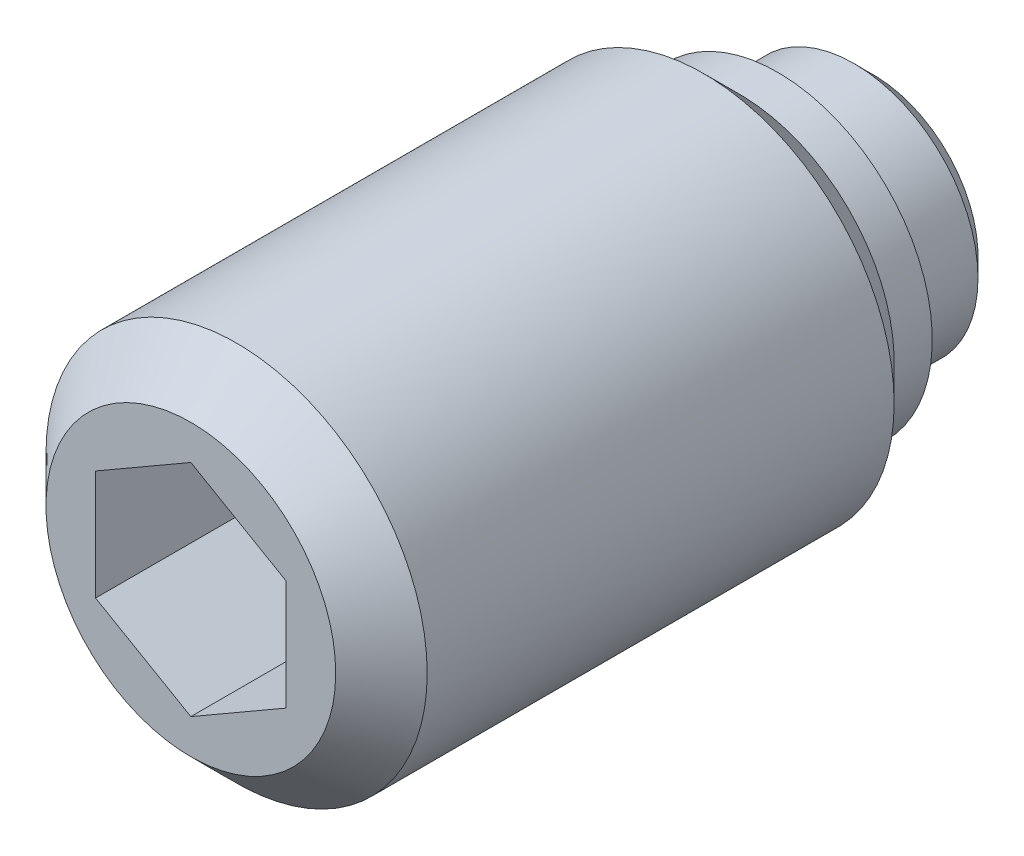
ISO-10303-21;
HEADER;
FILE_DESCRIPTION(('STEP AP214'),'2;1');
FILE_NAME('part.step','',(''),(''),'','','');
FILE_SCHEMA(('AUTOMOTIVE_DESIGN { 1 0 10303 214 1 1 1 1 }'));
ENDSEC;
DATA;
#1=APPLICATION_CONTEXT('core data for automotive mechanical design processes');
#2=APPLICATION_PROTOCOL_DEFINITION('international standard','automotive_design',2000,#1);
#3=PRODUCT_CONTEXT('',#1,'mechanical');
#4=PRODUCT('Part','Part','',(#3));
#5=PRODUCT_RELATED_PRODUCT_CATEGORY('part','',(#4));
#6=PRODUCT_DEFINITION_FORMATION('','',#4);
#7=PRODUCT_DEFINITION_CONTEXT('part definition',#1,'design');
#8=PRODUCT_DEFINITION('design','',#6,#7);
#9=PRODUCT_DEFINITION_SHAPE('','',#8);
#10=(LENGTH_UNIT() NAMED_UNIT(*) SI_UNIT(.MILLI.,.METRE.));
#11=(NAMED_UNIT(*) PLANE_ANGLE_UNIT() SI_UNIT($,.RADIAN.));
#12=(NAMED_UNIT(*) SI_UNIT($,.STERADIAN.) SOLID_ANGLE_UNIT());
#13=UNCERTAINTY_MEASURE_WITH_UNIT(LENGTH_MEASURE(1.E-05),#10,'distance_accuracy_value','');
#14=(GEOMETRIC_REPRESENTATION_CONTEXT(3) GLOBAL_UNCERTAINTY_ASSIGNED_CONTEXT((#13)) GLOBAL_UNIT_ASSIGNED_CONTEXT((#10,
#11,#12)) REPRESENTATION_CONTEXT('',''));
#15=CARTESIAN_POINT('',(0.,0.,0.));
#16=DIRECTION('',(0.,0.,1.));
#17=DIRECTION('',(1.,0.,0.));
#18=AXIS2_PLACEMENT_3D('',#15,#16,#17);
#19=CARTESIAN_POINT('',(0.,0.,0.));
#20=DIRECTION('',(0.,0.,-1.));
#21=DIRECTION('',(-1.,0.,0.));
#22=AXIS2_PLACEMENT_3D('',#19,#20,#21);
#23=CYLINDRICAL_SURFACE('',#22,3.25);
#24=CARTESIAN_POINT('',(0.,0.,0.5));
#25=DIRECTION('',(0.,0.,-1.));
#26=DIRECTION('',(-1.,0.,0.));
#27=AXIS2_PLACEMENT_3D('',#24,#25,#26);
#28=CIRCLE('',#27,3.25);
#29=CARTESIAN_POINT('',(-3.25,0.,0.5));
#30=VERTEX_POINT('',#29);
#31=EDGE_CURVE('E133',#30,#30,#28,.T.);
#32=ORIENTED_EDGE('',*,*,#31,.F.);
#33=EDGE_LOOP('',(#32));
#34=FACE_BOUND('',#33,.T.);
#35=CARTESIAN_POINT('',(0.,0.,2.5));
#36=DIRECTION('',(0.,0.,-1.));
#37=DIRECTION('',(-1.,0.,0.));
#38=AXIS2_PLACEMENT_3D('',#35,#36,#37);
#39=CIRCLE('',#38,3.25);
#40=CARTESIAN_POINT('',(-3.25,0.,2.5));
#41=VERTEX_POINT('',#40);
#42=EDGE_CURVE('E127',#41,#41,#39,.T.);
#43=ORIENTED_EDGE('',*,*,#42,.T.);
#44=EDGE_LOOP('',(#43));
#45=FACE_BOUND('',#44,.T.);
#46=ADVANCED_FACE('F14',(#34,#45),#23,.T.);
#47=CARTESIAN_POINT('',(0.,0.,0.5));
#48=DIRECTION('',(0.,0.,1.));
#49=DIRECTION('',(1.,0.,0.));
#50=AXIS2_PLACEMENT_3D('',#47,#48,#49);
#51=CONICAL_SURFACE('',#50,3.25,0.785398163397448);
#52=CARTESIAN_POINT('',(0.,0.,0.));
#53=DIRECTION('',(0.,0.,-1.));
#54=DIRECTION('',(-1.,0.,0.));
#55=AXIS2_PLACEMENT_3D('',#52,#53,#54);
#56=CIRCLE('',#55,2.75);
#57=CARTESIAN_POINT('',(-2.75,0.,0.));
#58=VERTEX_POINT('',#57);
#59=EDGE_CURVE('E130',#58,#58,#56,.T.);
#60=ORIENTED_EDGE('',*,*,#59,.F.);
#61=EDGE_LOOP('',(#60));
#62=FACE_BOUND('',#61,.T.);
#63=ORIENTED_EDGE('',*,*,#31,.T.);
#64=EDGE_LOOP('',(#63));
#65=FACE_BOUND('',#64,.T.);
#66=ADVANCED_FACE('F159',(#62,#65),#51,.T.);
#67=CARTESIAN_POINT('',(0.,2.75,0.));
#68=DIRECTION('',(0.,0.,1.));
#69=DIRECTION('',(1.,0.,0.));
#70=AXIS2_PLACEMENT_3D('',#67,#68,#69);
#71=PLANE('',#70);
#72=ORIENTED_EDGE('',*,*,#59,.T.);
#73=EDGE_LOOP('',(#72));
#74=FACE_BOUND('',#73,.T.);
#75=ADVANCED_FACE('F165',(#74),#71,.F.);
#76=CARTESIAN_POINT('',(0.,0.,2.5));
#77=DIRECTION('',(0.,0.,-1.));
#78=DIRECTION('',(-1.,0.,0.));
#79=AXIS2_PLACEMENT_3D('',#76,#77,#78);
#80=CYLINDRICAL_SURFACE('',#79,5.);
#81=CARTESIAN_POINT('',(0.,0.,4.45));
#82=DIRECTION('',(0.,0.,-1.));
#83=DIRECTION('',(-1.,0.,0.));
#84=AXIS2_PLACEMENT_3D('',#81,#82,#83);
#85=CIRCLE('',#84,5.);
#86=CARTESIAN_POINT('',(-5.,0.,4.45));
#87=VERTEX_POINT('',#86);
#88=EDGE_CURVE('E9',#87,#87,#85,.T.);
#89=ORIENTED_EDGE('',*,*,#88,.F.);
#90=EDGE_LOOP('',(#89));
#91=FACE_BOUND('',#90,.T.);
#92=CARTESIAN_POINT('',(0.,0.,16.7));
#93=DIRECTION('',(0.,0.,1.));
#94=DIRECTION('',(1.,0.,0.));
#95=AXIS2_PLACEMENT_3D('',#92,#93,#94);
#96=CIRCLE('',#95,5.);
#97=CARTESIAN_POINT('',(5.,0.,16.7));
#98=VERTEX_POINT('',#97);
#99=EDGE_CURVE('E124',#98,#98,#96,.T.);
#100=ORIENTED_EDGE('',*,*,#99,.F.);
#101=EDGE_LOOP('',(#100));
#102=FACE_BOUND('',#101,.T.);
#103=ADVANCED_FACE('F16',(#91,#102),#80,.T.);
#104=CARTESIAN_POINT('',(0.,4.05,2.5));
#105=DIRECTION('',(0.,0.,1.));
#106=DIRECTION('',(1.,0.,0.));
#107=AXIS2_PLACEMENT_3D('',#104,#105,#106);
#108=PLANE('',#107);
#109=CARTESIAN_POINT('',(0.,0.,2.5));
#110=DIRECTION('',(0.,0.,-1.));
#111=DIRECTION('',(-1.,0.,0.));
#112=AXIS2_PLACEMENT_3D('',#109,#110,#111);
#113=CIRCLE('',#112,4.05);
#114=CARTESIAN_POINT('',(-4.05,0.,2.5));
#115=VERTEX_POINT('',#114);
#116=EDGE_CURVE('E136',#115,#115,#113,.T.);
#117=ORIENTED_EDGE('',*,*,#116,.T.);
#118=EDGE_LOOP('',(#117));
#119=FACE_BOUND('',#118,.T.);
#120=ORIENTED_EDGE('',*,*,#42,.F.);
#121=EDGE_LOOP('',(#120));
#122=FACE_BOUND('',#121,.T.);
#123=ADVANCED_FACE('F156',(#119,#122),#108,.F.);
#124=CARTESIAN_POINT('',(0.,0.,2.5));
#125=DIRECTION('',(0.,0.,-1.));
#126=DIRECTION('',(-1.,0.,0.));
#127=AXIS2_PLACEMENT_3D('',#124,#125,#126);
#128=CYLINDRICAL_SURFACE('',#127,4.05);
#129=CARTESIAN_POINT('',(0.,0.,3.5));
#130=DIRECTION('',(0.,0.,-1.));
#131=DIRECTION('',(-1.,0.,0.));
#132=AXIS2_PLACEMENT_3D('',#129,#130,#131);
#133=CIRCLE('',#132,4.05);
#134=CARTESIAN_POINT('',(-4.05,0.,3.5));
#135=VERTEX_POINT('',#134);
#136=EDGE_CURVE('E22',#135,#135,#133,.T.);
#137=ORIENTED_EDGE('',*,*,#136,.T.);
#138=EDGE_LOOP('',(#137));
#139=FACE_BOUND('',#138,.T.);
#140=ORIENTED_EDGE('',*,*,#116,.F.);
#141=EDGE_LOOP('',(#140));
#142=FACE_BOUND('',#141,.T.);
#143=ADVANCED_FACE('F141',(#139,#142),#128,.T.);
#144=CARTESIAN_POINT('',(0.,0.,4.45));
#145=DIRECTION('',(0.,0.,1.));
#146=DIRECTION('',(1.,0.,0.));
#147=AXIS2_PLACEMENT_3D('',#144,#145,#146);
#148=CONICAL_SURFACE('',#147,5.,0.785398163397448);
#149=ORIENTED_EDGE('',*,*,#88,.T.);
#150=EDGE_LOOP('',(#149));
#151=FACE_BOUND('',#150,.T.);
#152=ORIENTED_EDGE('',*,*,#136,.F.);
#153=EDGE_LOOP('',(#152));
#154=FACE_BOUND('',#153,.T.);
#155=ADVANCED_FACE('F144',(#151,#154),#148,.T.);
#156=CARTESIAN_POINT('',(0.,-3.8,17.9));
#157=DIRECTION('',(0.,0.,1.));
#158=DIRECTION('',(1.,0.,0.));
#159=AXIS2_PLACEMENT_3D('',#156,#157,#158);
#160=PLANE('',#159);
#161=DIRECTION('',(0.866025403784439,-0.5,0.));
#162=VECTOR('',#161,1.);
#163=CARTESIAN_POINT('',(-2.5,-1.44337567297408,17.9));
#164=LINE('',#163,#162);
#165=CARTESIAN_POINT('',(-2.5,-1.44337567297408,17.9));
#166=VERTEX_POINT('',#165);
#167=CARTESIAN_POINT('',(0.,-2.88675134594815,17.9));
#168=VERTEX_POINT('',#167);
#169=EDGE_CURVE('E29',#166,#168,#164,.T.);
#170=ORIENTED_EDGE('',*,*,#169,.F.);
#171=DIRECTION('',(0.,-1.,0.));
#172=VECTOR('',#171,1.);
#173=CARTESIAN_POINT('',(-2.5,1.44337567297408,17.9));
#174=LINE('',#173,#172);
#175=CARTESIAN_POINT('',(-2.5,1.44337567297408,17.9));
#176=VERTEX_POINT('',#175);
#177=EDGE_CURVE('E112',#176,#166,#174,.T.);
#178=ORIENTED_EDGE('',*,*,#177,.F.);
#179=DIRECTION('',(-0.866025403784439,-0.5,0.));
#180=VECTOR('',#179,1.);
#181=CARTESIAN_POINT('',(0.,2.88675134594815,17.9));
#182=LINE('',#181,#180);
#183=CARTESIAN_POINT('',(0.,2.88675134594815,17.9));
#184=VERTEX_POINT('',#183);
#185=EDGE_CURVE('E110',#184,#176,#182,.T.);
#186=ORIENTED_EDGE('',*,*,#185,.F.);
#187=DIRECTION('',(-0.866025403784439,0.5,0.));
#188=VECTOR('',#187,1.);
#189=CARTESIAN_POINT('',(2.5,1.44337567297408,17.9));
#190=LINE('',#189,#188);
#191=CARTESIAN_POINT('',(2.5,1.44337567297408,17.9));
#192=VERTEX_POINT('',#191);
#193=EDGE_CURVE('E77',#192,#184,#190,.T.);
#194=ORIENTED_EDGE('',*,*,#193,.F.);
#195=DIRECTION('',(0.,1.,0.));
#196=VECTOR('',#195,1.);
#197=CARTESIAN_POINT('',(2.5,-1.44337567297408,17.9));
#198=LINE('',#197,#196);
#199=CARTESIAN_POINT('',(2.5,-1.44337567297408,17.9));
#200=VERTEX_POINT('',#199);
#201=EDGE_CURVE('E106',#200,#192,#198,.T.);
#202=ORIENTED_EDGE('',*,*,#201,.F.);
#203=DIRECTION('',(0.866025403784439,0.5,0.));
#204=VECTOR('',#203,1.);
#205=CARTESIAN_POINT('',(0.,-2.88675134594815,17.9));
#206=LINE('',#205,#204);
#207=EDGE_CURVE('E103',#168,#200,#206,.T.);
#208=ORIENTED_EDGE('',*,*,#207,.F.);
#209=EDGE_LOOP('',(#170,#178,#186,#194,#202,#208));
#210=FACE_BOUND('',#209,.T.);
#211=CARTESIAN_POINT('',(0.,0.,17.9));
#212=DIRECTION('',(0.,0.,1.));
#213=DIRECTION('',(1.,0.,0.));
#214=AXIS2_PLACEMENT_3D('',#211,#212,#213);
#215=CIRCLE('',#214,3.8);
#216=CARTESIAN_POINT('',(3.8,0.,17.9));
#217=VERTEX_POINT('',#216);
#218=EDGE_CURVE('E116',#217,#217,#215,.T.);
#219=ORIENTED_EDGE('',*,*,#218,.T.);
#220=EDGE_LOOP('',(#219));
#221=FACE_BOUND('',#220,.T.);
#222=ADVANCED_FACE('F146',(#210,#221),#160,.T.);
#223=CARTESIAN_POINT('',(0.,0.,17.9));
#224=DIRECTION('',(0.,0.,-1.));
#225=DIRECTION('',(-1.,0.,0.));
#226=AXIS2_PLACEMENT_3D('',#223,#224,#225);
#227=CONICAL_SURFACE('',#226,3.8,0.785398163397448);
#228=ORIENTED_EDGE('',*,*,#99,.T.);
#229=EDGE_LOOP('',(#228));
#230=FACE_BOUND('',#229,.T.);
#231=ORIENTED_EDGE('',*,*,#218,.F.);
#232=EDGE_LOOP('',(#231));
#233=FACE_BOUND('',#232,.T.);
#234=ADVANCED_FACE('F153',(#230,#233),#227,.T.);
#235=CARTESIAN_POINT('',(-2.5,-1.44337567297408,11.9));
#236=DIRECTION('',(-0.5,-0.866025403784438,0.));
#237=DIRECTION('',(0.866025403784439,-0.5,0.));
#238=AXIS2_PLACEMENT_3D('',#235,#236,#237);
#239=PLANE('',#238);
#240=ORIENTED_EDGE('',*,*,#169,.T.);
#241=DIRECTION('',(0.,0.,1.));
#242=VECTOR('',#241,1.);
#243=CARTESIAN_POINT('',(0.,-2.88675134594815,11.9));
#244=LINE('',#243,#242);
#245=CARTESIAN_POINT('',(0.,-2.88675134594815,11.9));
#246=VERTEX_POINT('',#245);
#247=EDGE_CURVE('E59',#246,#168,#244,.T.);
#248=ORIENTED_EDGE('',*,*,#247,.F.);
#249=DIRECTION('',(0.866025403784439,-0.5,0.));
#250=VECTOR('',#249,1.);
#251=CARTESIAN_POINT('',(-2.5,-1.44337567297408,11.9));
#252=LINE('',#251,#250);
#253=CARTESIAN_POINT('',(-2.5,-1.44337567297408,11.9));
#254=VERTEX_POINT('',#253);
#255=EDGE_CURVE('E114',#254,#246,#252,.T.);
#256=ORIENTED_EDGE('',*,*,#255,.F.);
#257=DIRECTION('',(0.,0.,1.));
#258=VECTOR('',#257,1.);
#259=CARTESIAN_POINT('',(-2.5,-1.44337567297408,11.9));
#260=LINE('',#259,#258);
#261=EDGE_CURVE('E37',#254,#166,#260,.T.);
#262=ORIENTED_EDGE('',*,*,#261,.T.);
#263=EDGE_LOOP('',(#240,#248,#256,#262));
#264=FACE_BOUND('',#263,.T.);
#265=ADVANCED_FACE('F191',(#264),#239,.F.);
#266=CARTESIAN_POINT('',(-2.5,1.44337567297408,11.9));
#267=DIRECTION('',(-1.,0.,0.));
#268=DIRECTION('',(0.,0.,1.));
#269=AXIS2_PLACEMENT_3D('',#266,#267,#268);
#270=PLANE('',#269);
#271=ORIENTED_EDGE('',*,*,#177,.T.);
#272=ORIENTED_EDGE('',*,*,#261,.F.);
#273=DIRECTION('',(0.,-1.,0.));
#274=VECTOR('',#273,1.);
#275=CARTESIAN_POINT('',(-2.5,1.44337567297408,11.9));
#276=LINE('',#275,#274);
#277=CARTESIAN_POINT('',(-2.5,1.44337567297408,11.9));
#278=VERTEX_POINT('',#277);
#279=EDGE_CURVE('E89',#278,#254,#276,.T.);
#280=ORIENTED_EDGE('',*,*,#279,.F.);
#281=DIRECTION('',(0.,0.,1.));
#282=VECTOR('',#281,1.);
#283=CARTESIAN_POINT('',(-2.5,1.44337567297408,11.9));
#284=LINE('',#283,#282);
#285=EDGE_CURVE('E81',#278,#176,#284,.T.);
#286=ORIENTED_EDGE('',*,*,#285,.T.);
#287=EDGE_LOOP('',(#271,#272,#280,#286));
#288=FACE_BOUND('',#287,.T.);
#289=ADVANCED_FACE('F198',(#288),#270,.F.);
#290=CARTESIAN_POINT('',(0.,2.88675134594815,11.9));
#291=DIRECTION('',(-0.5,0.866025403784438,0.));
#292=DIRECTION('',(-0.866025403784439,-0.5,0.));
#293=AXIS2_PLACEMENT_3D('',#290,#291,#292);
#294=PLANE('',#293);
#295=ORIENTED_EDGE('',*,*,#185,.T.);
#296=ORIENTED_EDGE('',*,*,#285,.F.);
#297=DIRECTION('',(-0.866025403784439,-0.5,0.));
#298=VECTOR('',#297,1.);
#299=CARTESIAN_POINT('',(0.,2.88675134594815,11.9));
#300=LINE('',#299,#298);
#301=CARTESIAN_POINT('',(0.,2.88675134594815,11.9));
#302=VERTEX_POINT('',#301);
#303=EDGE_CURVE('E85',#302,#278,#300,.T.);
#304=ORIENTED_EDGE('',*,*,#303,.F.);
#305=DIRECTION('',(0.,0.,1.));
#306=VECTOR('',#305,1.);
#307=CARTESIAN_POINT('',(0.,2.88675134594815,11.9));
#308=LINE('',#307,#306);
#309=EDGE_CURVE('E70',#302,#184,#308,.T.);
#310=ORIENTED_EDGE('',*,*,#309,.T.);
#311=EDGE_LOOP('',(#295,#296,#304,#310));
#312=FACE_BOUND('',#311,.T.);
#313=ADVANCED_FACE('F86',(#312),#294,.F.);
#314=CARTESIAN_POINT('',(2.5,1.44337567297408,11.9));
#315=DIRECTION('',(0.5,0.866025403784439,0.));
#316=DIRECTION('',(-0.866025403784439,0.5,0.));
#317=AXIS2_PLACEMENT_3D('',#314,#315,#316);
#318=PLANE('',#317);
#319=ORIENTED_EDGE('',*,*,#193,.T.);
#320=ORIENTED_EDGE('',*,*,#309,.F.);
#321=DIRECTION('',(-0.866025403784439,0.5,0.));
#322=VECTOR('',#321,1.);
#323=CARTESIAN_POINT('',(2.5,1.44337567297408,11.9));
#324=LINE('',#323,#322);
#325=CARTESIAN_POINT('',(2.5,1.44337567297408,11.9));
#326=VERTEX_POINT('',#325);
#327=EDGE_CURVE('E74',#326,#302,#324,.T.);
#328=ORIENTED_EDGE('',*,*,#327,.F.);
#329=DIRECTION('',(0.,0.,1.));
#330=VECTOR('',#329,1.);
#331=CARTESIAN_POINT('',(2.5,1.44337567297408,11.9));
#332=LINE('',#331,#330);
#333=EDGE_CURVE('E82',#326,#192,#332,.T.);
#334=ORIENTED_EDGE('',*,*,#333,.T.);
#335=EDGE_LOOP('',(#319,#320,#328,#334));
#336=FACE_BOUND('',#335,.T.);
#337=ADVANCED_FACE('F72',(#336),#318,.F.);
#338=CARTESIAN_POINT('',(2.5,-1.44337567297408,11.9));
#339=DIRECTION('',(1.,0.,0.));
#340=DIRECTION('',(0.,1.,0.));
#341=AXIS2_PLACEMENT_3D('',#338,#339,#340);
#342=PLANE('',#341);
#343=ORIENTED_EDGE('',*,*,#201,.T.);
#344=ORIENTED_EDGE('',*,*,#333,.F.);
#345=DIRECTION('',(0.,1.,0.));
#346=VECTOR('',#345,1.);
#347=CARTESIAN_POINT('',(2.5,-1.44337567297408,11.9));
#348=LINE('',#347,#346);
#349=CARTESIAN_POINT('',(2.5,-1.44337567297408,11.9));
#350=VERTEX_POINT('',#349);
#351=EDGE_CURVE('E95',#350,#326,#348,.T.);
#352=ORIENTED_EDGE('',*,*,#351,.F.);
#353=DIRECTION('',(0.,0.,1.));
#354=VECTOR('',#353,1.);
#355=CARTESIAN_POINT('',(2.5,-1.44337567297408,11.9));
#356=LINE('',#355,#354);
#357=EDGE_CURVE('E119',#350,#200,#356,.T.);
#358=ORIENTED_EDGE('',*,*,#357,.T.);
#359=EDGE_LOOP('',(#343,#344,#352,#358));
#360=FACE_BOUND('',#359,.T.);
#361=ADVANCED_FACE('F204',(#360),#342,.F.);
#362=CARTESIAN_POINT('',(0.,-2.88675134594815,11.9));
#363=DIRECTION('',(0.5,-0.866025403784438,0.));
#364=DIRECTION('',(0.866025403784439,0.5,0.));
#365=AXIS2_PLACEMENT_3D('',#362,#363,#364);
#366=PLANE('',#365);
#367=ORIENTED_EDGE('',*,*,#207,.T.);
#368=ORIENTED_EDGE('',*,*,#357,.F.);
#369=DIRECTION('',(0.866025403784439,0.5,0.));
#370=VECTOR('',#369,1.);
#371=CARTESIAN_POINT('',(0.,-2.88675134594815,11.9));
#372=LINE('',#371,#370);
#373=EDGE_CURVE('E97',#246,#350,#372,.T.);
#374=ORIENTED_EDGE('',*,*,#373,.F.);
#375=ORIENTED_EDGE('',*,*,#247,.T.);
#376=EDGE_LOOP('',(#367,#368,#374,#375));
#377=FACE_BOUND('',#376,.T.);
#378=ADVANCED_FACE('F201',(#377),#366,.F.);
#379=CARTESIAN_POINT('',(0.,0.,11.9));
#380=DIRECTION('',(0.,0.,1.));
#381=DIRECTION('',(1.,0.,0.));
#382=AXIS2_PLACEMENT_3D('',#379,#380,#381);
#383=PLANE('',#382);
#384=ORIENTED_EDGE('',*,*,#255,.T.);
#385=ORIENTED_EDGE('',*,*,#373,.T.);
#386=ORIENTED_EDGE('',*,*,#351,.T.);
#387=ORIENTED_EDGE('',*,*,#327,.T.);
#388=ORIENTED_EDGE('',*,*,#303,.T.);
#389=ORIENTED_EDGE('',*,*,#279,.T.);
#390=EDGE_LOOP('',(#384,#385,#386,#387,#388,#389));
#391=FACE_BOUND('',#390,.T.);
#392=ADVANCED_FACE('F92',(#391),#383,.T.);
#393=CLOSED_SHELL('',(#46,#66,#75,#103,#123,#143,#155,#222,#234,#265,#289,#313,#337,#361,#378,#392));
#394=MANIFOLD_SOLID_BREP('B1',#393);
#395=ADVANCED_BREP_SHAPE_REPRESENTATION('',(#18,#394),#14);
#396=SHAPE_DEFINITION_REPRESENTATION(#9,#395);
ENDSEC;
END-ISO-10303-21;
